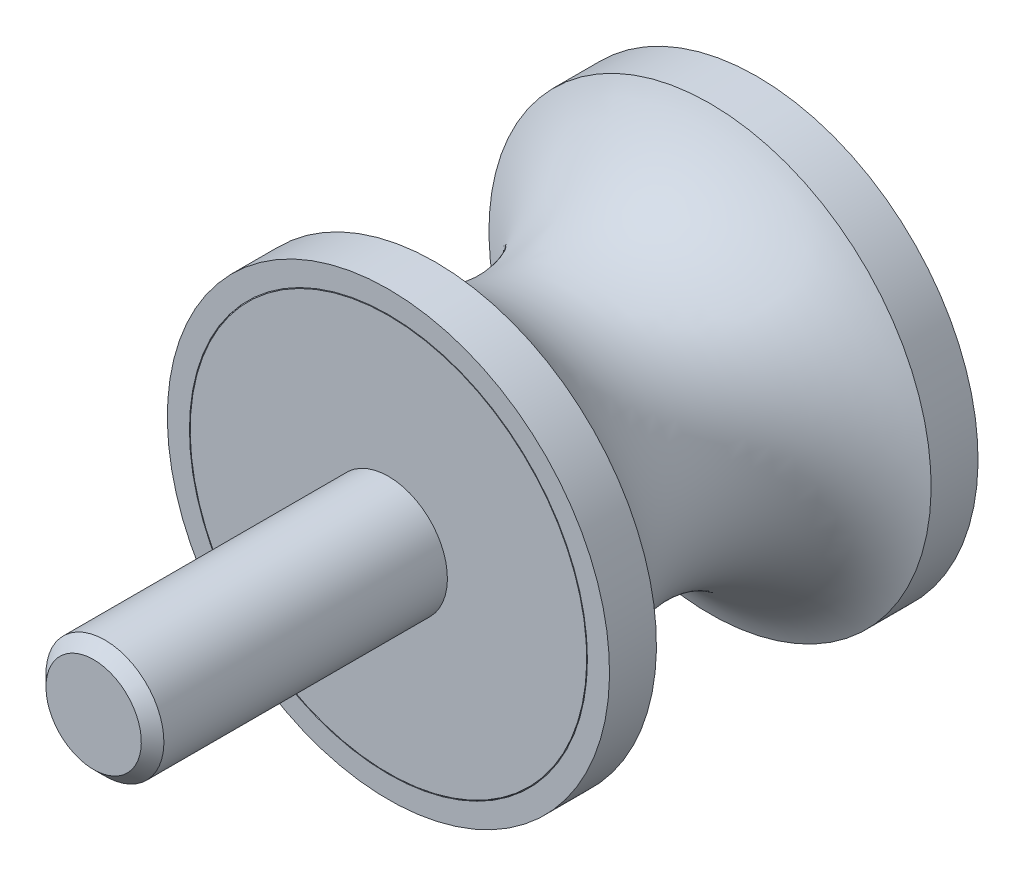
ISO-10303-21;
HEADER;
FILE_DESCRIPTION(('STEP AP214'),'2;1');
FILE_NAME('part.step','',(''),(''),'','','');
FILE_SCHEMA(('AUTOMOTIVE_DESIGN { 1 0 10303 214 1 1 1 1 }'));
ENDSEC;
DATA;
#1=APPLICATION_CONTEXT('core data for automotive mechanical design processes');
#2=APPLICATION_PROTOCOL_DEFINITION('international standard','automotive_design',2000,#1);
#3=PRODUCT_CONTEXT('',#1,'mechanical');
#4=PRODUCT('Part','Part','',(#3));
#5=PRODUCT_RELATED_PRODUCT_CATEGORY('part','',(#4));
#6=PRODUCT_DEFINITION_FORMATION('','',#4);
#7=PRODUCT_DEFINITION_CONTEXT('part definition',#1,'design');
#8=PRODUCT_DEFINITION('design','',#6,#7);
#9=PRODUCT_DEFINITION_SHAPE('','',#8);
#10=(LENGTH_UNIT() NAMED_UNIT(*) SI_UNIT(.MILLI.,.METRE.));
#11=(NAMED_UNIT(*) PLANE_ANGLE_UNIT() SI_UNIT($,.RADIAN.));
#12=(NAMED_UNIT(*) SI_UNIT($,.STERADIAN.) SOLID_ANGLE_UNIT());
#13=UNCERTAINTY_MEASURE_WITH_UNIT(LENGTH_MEASURE(1.E-05),#10,'distance_accuracy_value','');
#14=(GEOMETRIC_REPRESENTATION_CONTEXT(3) GLOBAL_UNCERTAINTY_ASSIGNED_CONTEXT((#13)) GLOBAL_UNIT_ASSIGNED_CONTEXT((#10,
#11,#12)) REPRESENTATION_CONTEXT('',''));
#15=CARTESIAN_POINT('',(0.,0.,0.));
#16=DIRECTION('',(0.,0.,1.));
#17=DIRECTION('',(1.,0.,0.));
#18=AXIS2_PLACEMENT_3D('',#15,#16,#17);
#19=CARTESIAN_POINT('',(0.,0.,0.5));
#20=DIRECTION('',(0.,0.,-1.));
#21=DIRECTION('',(0.,1.,0.));
#22=AXIS2_PLACEMENT_3D('',#19,#20,#21);
#23=CYLINDRICAL_SURFACE('',#22,13.5);
#24=CARTESIAN_POINT('',(0.,0.,0.05));
#25=DIRECTION('',(0.,0.,-1.));
#26=DIRECTION('',(0.,1.,0.));
#27=AXIS2_PLACEMENT_3D('',#24,#25,#26);
#28=CIRCLE('',#27,13.5);
#29=CARTESIAN_POINT('',(0.,13.5,0.05));
#30=VERTEX_POINT('',#29);
#31=EDGE_CURVE('E53',#30,#30,#28,.T.);
#32=ORIENTED_EDGE('',*,*,#31,.F.);
#33=EDGE_LOOP('',(#32));
#34=FACE_BOUND('',#33,.T.);
#35=CARTESIAN_POINT('',(0.,0.,0.));
#36=DIRECTION('',(0.,0.,-1.));
#37=DIRECTION('',(0.,1.,0.));
#38=AXIS2_PLACEMENT_3D('',#35,#36,#37);
#39=CIRCLE('',#38,13.5);
#40=CARTESIAN_POINT('',(0.,13.5,0.));
#41=VERTEX_POINT('',#40);
#42=EDGE_CURVE('E44',#41,#41,#39,.T.);
#43=ORIENTED_EDGE('',*,*,#42,.T.);
#44=EDGE_LOOP('',(#43));
#45=FACE_BOUND('',#44,.T.);
#46=ADVANCED_FACE('F12',(#34,#45),#23,.F.);
#47=CARTESIAN_POINT('',(0.,0.,0.5));
#48=DIRECTION('',(0.,0.,-1.));
#49=DIRECTION('',(0.,1.,0.));
#50=AXIS2_PLACEMENT_3D('',#47,#48,#49);
#51=CYLINDRICAL_SURFACE('',#50,13.5);
#52=CARTESIAN_POINT('',(0.,0.,25.));
#53=DIRECTION('',(0.,0.,-1.));
#54=DIRECTION('',(0.,1.,0.));
#55=AXIS2_PLACEMENT_3D('',#52,#53,#54);
#56=CIRCLE('',#55,13.5);
#57=CARTESIAN_POINT('',(0.,13.5,25.));
#58=VERTEX_POINT('',#57);
#59=EDGE_CURVE('E27',#58,#58,#56,.T.);
#60=ORIENTED_EDGE('',*,*,#59,.F.);
#61=EDGE_LOOP('',(#60));
#62=FACE_BOUND('',#61,.T.);
#63=CARTESIAN_POINT('',(0.,0.,24.95));
#64=DIRECTION('',(0.,0.,-1.));
#65=DIRECTION('',(0.,1.,0.));
#66=AXIS2_PLACEMENT_3D('',#63,#64,#65);
#67=CIRCLE('',#66,13.5);
#68=CARTESIAN_POINT('',(0.,13.5,24.95));
#69=VERTEX_POINT('',#68);
#70=EDGE_CURVE('E50',#69,#69,#67,.T.);
#71=ORIENTED_EDGE('',*,*,#70,.T.);
#72=EDGE_LOOP('',(#71));
#73=FACE_BOUND('',#72,.T.);
#74=ADVANCED_FACE('F89',(#62,#73),#51,.F.);
#75=CARTESIAN_POINT('',(13.5,0.,25.));
#76=DIRECTION('',(0.,0.,-1.));
#77=DIRECTION('',(0.,1.,0.));
#78=AXIS2_PLACEMENT_3D('',#75,#76,#77);
#79=PLANE('',#78);
#80=CARTESIAN_POINT('',(0.,0.,25.));
#81=DIRECTION('',(0.,0.,-1.));
#82=DIRECTION('',(0.,1.,0.));
#83=AXIS2_PLACEMENT_3D('',#80,#81,#82);
#84=CIRCLE('',#83,15.);
#85=CARTESIAN_POINT('',(0.,15.,25.));
#86=VERTEX_POINT('',#85);
#87=EDGE_CURVE('E32',#86,#86,#84,.T.);
#88=ORIENTED_EDGE('',*,*,#87,.F.);
#89=EDGE_LOOP('',(#88));
#90=FACE_BOUND('',#89,.T.);
#91=ORIENTED_EDGE('',*,*,#59,.T.);
#92=EDGE_LOOP('',(#91));
#93=FACE_BOUND('',#92,.T.);
#94=ADVANCED_FACE('F115',(#90,#93),#79,.F.);
#95=CARTESIAN_POINT('',(0.,0.,0.5));
#96=DIRECTION('',(0.,0.,-1.));
#97=DIRECTION('',(0.,1.,0.));
#98=AXIS2_PLACEMENT_3D('',#95,#96,#97);
#99=CYLINDRICAL_SURFACE('',#98,15.);
#100=CARTESIAN_POINT('',(0.,0.,21.8169499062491));
#101=DIRECTION('',(0.,0.,-1.));
#102=DIRECTION('',(0.,1.,0.));
#103=AXIS2_PLACEMENT_3D('',#100,#101,#102);
#104=CIRCLE('',#103,15.);
#105=CARTESIAN_POINT('',(0.,15.,21.8169499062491));
#106=VERTEX_POINT('',#105);
#107=EDGE_CURVE('E35',#106,#106,#104,.T.);
#108=ORIENTED_EDGE('',*,*,#107,.F.);
#109=EDGE_LOOP('',(#108));
#110=FACE_BOUND('',#109,.T.);
#111=ORIENTED_EDGE('',*,*,#87,.T.);
#112=EDGE_LOOP('',(#111));
#113=FACE_BOUND('',#112,.T.);
#114=ADVANCED_FACE('F109',(#110,#113),#99,.T.);
#115=CARTESIAN_POINT('',(0.,0.,12.5));
#116=DIRECTION('',(0.,0.,-1.));
#117=DIRECTION('',(0.,1.,0.));
#118=AXIS2_PLACEMENT_3D('',#115,#116,#117);
#119=TOROIDAL_SURFACE('',#118,19.2337962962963,10.2337962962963);
#120=CARTESIAN_POINT('',(0.,0.,3.18305009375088));
#121=DIRECTION('',(0.,0.,-1.));
#122=DIRECTION('',(0.,1.,0.));
#123=AXIS2_PLACEMENT_3D('',#120,#121,#122);
#124=CIRCLE('',#123,15.);
#125=CARTESIAN_POINT('',(0.,15.,3.18305009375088));
#126=VERTEX_POINT('',#125);
#127=EDGE_CURVE('E38',#126,#126,#124,.T.);
#128=ORIENTED_EDGE('',*,*,#127,.F.);
#129=EDGE_LOOP('',(#128));
#130=FACE_BOUND('',#129,.T.);
#131=ORIENTED_EDGE('',*,*,#107,.T.);
#132=EDGE_LOOP('',(#131));
#133=FACE_BOUND('',#132,.T.);
#134=ADVANCED_FACE('F103',(#130,#133),#119,.F.);
#135=CARTESIAN_POINT('',(0.,0.,0.5));
#136=DIRECTION('',(0.,0.,-1.));
#137=DIRECTION('',(0.,1.,0.));
#138=AXIS2_PLACEMENT_3D('',#135,#136,#137);
#139=CYLINDRICAL_SURFACE('',#138,15.);
#140=CARTESIAN_POINT('',(0.,0.,0.));
#141=DIRECTION('',(0.,0.,-1.));
#142=DIRECTION('',(0.,1.,0.));
#143=AXIS2_PLACEMENT_3D('',#140,#141,#142);
#144=CIRCLE('',#143,15.);
#145=CARTESIAN_POINT('',(0.,15.,0.));
#146=VERTEX_POINT('',#145);
#147=EDGE_CURVE('E41',#146,#146,#144,.T.);
#148=ORIENTED_EDGE('',*,*,#147,.F.);
#149=EDGE_LOOP('',(#148));
#150=FACE_BOUND('',#149,.T.);
#151=ORIENTED_EDGE('',*,*,#127,.T.);
#152=EDGE_LOOP('',(#151));
#153=FACE_BOUND('',#152,.T.);
#154=ADVANCED_FACE('F97',(#150,#153),#139,.T.);
#155=CARTESIAN_POINT('',(15.,0.,0.));
#156=DIRECTION('',(0.,0.,1.));
#157=DIRECTION('',(0.,-1.,0.));
#158=AXIS2_PLACEMENT_3D('',#155,#156,#157);
#159=PLANE('',#158);
#160=ORIENTED_EDGE('',*,*,#42,.F.);
#161=EDGE_LOOP('',(#160));
#162=FACE_BOUND('',#161,.T.);
#163=ORIENTED_EDGE('',*,*,#147,.T.);
#164=EDGE_LOOP('',(#163));
#165=FACE_BOUND('',#164,.T.);
#166=ADVANCED_FACE('F93',(#162,#165),#159,.F.);
#167=CARTESIAN_POINT('',(0.,0.,25.));
#168=DIRECTION('',(0.,0.,-1.));
#169=DIRECTION('',(0.,1.,0.));
#170=AXIS2_PLACEMENT_3D('',#167,#168,#169);
#171=PLANE('',#170);
#172=CARTESIAN_POINT('',(0.,0.,25.));
#173=DIRECTION('',(0.,0.,-1.));
#174=DIRECTION('',(0.,1.,0.));
#175=AXIS2_PLACEMENT_3D('',#172,#173,#174);
#176=CIRCLE('',#175,13.45);
#177=CARTESIAN_POINT('',(0.,13.45,25.));
#178=VERTEX_POINT('',#177);
#179=EDGE_CURVE('E47',#178,#178,#176,.T.);
#180=ORIENTED_EDGE('',*,*,#179,.F.);
#181=EDGE_LOOP('',(#180));
#182=FACE_BOUND('',#181,.T.);
#183=CARTESIAN_POINT('',(0.,0.,25.));
#184=DIRECTION('',(0.,0.,-1.));
#185=DIRECTION('',(0.,1.,0.));
#186=AXIS2_PLACEMENT_3D('',#183,#184,#185);
#187=CIRCLE('',#186,4.);
#188=CARTESIAN_POINT('',(0.,4.,25.));
#189=VERTEX_POINT('',#188);
#190=EDGE_CURVE('E8',#189,#189,#187,.T.);
#191=ORIENTED_EDGE('',*,*,#190,.T.);
#192=EDGE_LOOP('',(#191));
#193=FACE_BOUND('',#192,.T.);
#194=ADVANCED_FACE('F96',(#182,#193),#171,.F.);
#195=CARTESIAN_POINT('',(0.,0.,25.));
#196=DIRECTION('',(0.,0.,-1.));
#197=DIRECTION('',(0.,1.,0.));
#198=AXIS2_PLACEMENT_3D('',#195,#196,#197);
#199=CONICAL_SURFACE('',#198,13.45,0.785398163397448);
#200=ORIENTED_EDGE('',*,*,#70,.F.);
#201=EDGE_LOOP('',(#200));
#202=FACE_BOUND('',#201,.T.);
#203=ORIENTED_EDGE('',*,*,#179,.T.);
#204=EDGE_LOOP('',(#203));
#205=FACE_BOUND('',#204,.T.);
#206=ADVANCED_FACE('F129',(#202,#205),#199,.T.);
#207=CARTESIAN_POINT('',(0.,0.,45.));
#208=DIRECTION('',(0.,0.,-1.));
#209=DIRECTION('',(0.,1.,0.));
#210=AXIS2_PLACEMENT_3D('',#207,#208,#209);
#211=PLANE('',#210);
#212=CARTESIAN_POINT('',(0.,0.,45.));
#213=DIRECTION('',(0.,0.,-1.));
#214=DIRECTION('',(0.,1.,0.));
#215=AXIS2_PLACEMENT_3D('',#212,#213,#214);
#216=CIRCLE('',#215,3.233);
#217=CARTESIAN_POINT('',(0.,3.233,45.));
#218=VERTEX_POINT('',#217);
#219=EDGE_CURVE('E19',#218,#218,#216,.T.);
#220=ORIENTED_EDGE('',*,*,#219,.F.);
#221=EDGE_LOOP('',(#220));
#222=FACE_BOUND('',#221,.T.);
#223=ADVANCED_FACE('F14',(#222),#211,.F.);
#224=CARTESIAN_POINT('',(0.,0.,45.));
#225=DIRECTION('',(0.,0.,-1.));
#226=DIRECTION('',(0.,1.,0.));
#227=AXIS2_PLACEMENT_3D('',#224,#225,#226);
#228=CONICAL_SURFACE('',#227,3.233,0.785398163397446);
#229=CARTESIAN_POINT('',(0.,0.,44.233));
#230=DIRECTION('',(0.,0.,-1.));
#231=DIRECTION('',(0.,1.,0.));
#232=AXIS2_PLACEMENT_3D('',#229,#230,#231);
#233=CIRCLE('',#232,4.);
#234=CARTESIAN_POINT('',(0.,4.,44.233));
#235=VERTEX_POINT('',#234);
#236=EDGE_CURVE('E23',#235,#235,#233,.T.);
#237=ORIENTED_EDGE('',*,*,#236,.F.);
#238=EDGE_LOOP('',(#237));
#239=FACE_BOUND('',#238,.T.);
#240=ORIENTED_EDGE('',*,*,#219,.T.);
#241=EDGE_LOOP('',(#240));
#242=FACE_BOUND('',#241,.T.);
#243=ADVANCED_FACE('F142',(#239,#242),#228,.T.);
#244=CARTESIAN_POINT('',(0.,0.,0.5));
#245=DIRECTION('',(0.,0.,-1.));
#246=DIRECTION('',(0.,1.,0.));
#247=AXIS2_PLACEMENT_3D('',#244,#245,#246);
#248=CYLINDRICAL_SURFACE('',#247,4.);
#249=ORIENTED_EDGE('',*,*,#190,.F.);
#250=EDGE_LOOP('',(#249));
#251=FACE_BOUND('',#250,.T.);
#252=ORIENTED_EDGE('',*,*,#236,.T.);
#253=EDGE_LOOP('',(#252));
#254=FACE_BOUND('',#253,.T.);
#255=ADVANCED_FACE('F83',(#251,#254),#248,.T.);
#256=CARTESIAN_POINT('',(0.,0.,0.05));
#257=DIRECTION('',(0.,0.,1.));
#258=DIRECTION('',(0.,-1.,0.));
#259=AXIS2_PLACEMENT_3D('',#256,#257,#258);
#260=CONICAL_SURFACE('',#259,13.5,0.785398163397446);
#261=CARTESIAN_POINT('',(0.,0.,0.));
#262=DIRECTION('',(0.,0.,-1.));
#263=DIRECTION('',(0.,1.,0.));
#264=AXIS2_PLACEMENT_3D('',#261,#262,#263);
#265=CIRCLE('',#264,13.45);
#266=CARTESIAN_POINT('',(0.,13.45,0.));
#267=VERTEX_POINT('',#266);
#268=EDGE_CURVE('E56',#267,#267,#265,.T.);
#269=ORIENTED_EDGE('',*,*,#268,.F.);
#270=EDGE_LOOP('',(#269));
#271=FACE_BOUND('',#270,.T.);
#272=ORIENTED_EDGE('',*,*,#31,.T.);
#273=EDGE_LOOP('',(#272));
#274=FACE_BOUND('',#273,.T.);
#275=ADVANCED_FACE('F77',(#271,#274),#260,.T.);
#276=CARTESIAN_POINT('',(13.45,0.,0.));
#277=DIRECTION('',(0.,0.,1.));
#278=DIRECTION('',(0.,-1.,0.));
#279=AXIS2_PLACEMENT_3D('',#276,#277,#278);
#280=PLANE('',#279);
#281=CARTESIAN_POINT('',(0.,0.,0.));
#282=DIRECTION('',(0.,0.,-1.));
#283=DIRECTION('',(0.,1.,0.));
#284=AXIS2_PLACEMENT_3D('',#281,#282,#283);
#285=CIRCLE('',#284,4.);
#286=CARTESIAN_POINT('',(0.,4.,0.));
#287=VERTEX_POINT('',#286);
#288=EDGE_CURVE('E60',#287,#287,#285,.T.);
#289=ORIENTED_EDGE('',*,*,#288,.F.);
#290=EDGE_LOOP('',(#289));
#291=FACE_BOUND('',#290,.T.);
#292=ORIENTED_EDGE('',*,*,#268,.T.);
#293=EDGE_LOOP('',(#292));
#294=FACE_BOUND('',#293,.T.);
#295=ADVANCED_FACE('F71',(#291,#294),#280,.F.);
#296=CARTESIAN_POINT('',(0.,0.,8.));
#297=DIRECTION('',(0.,0.,-1.));
#298=DIRECTION('',(0.,1.,0.));
#299=AXIS2_PLACEMENT_3D('',#296,#297,#298);
#300=CYLINDRICAL_SURFACE('',#299,4.);
#301=CARTESIAN_POINT('',(0.,0.,8.));
#302=DIRECTION('',(0.,0.,-1.));
#303=DIRECTION('',(0.,1.,0.));
#304=AXIS2_PLACEMENT_3D('',#301,#302,#303);
#305=CIRCLE('',#304,4.);
#306=CARTESIAN_POINT('',(0.,4.,8.));
#307=VERTEX_POINT('',#306);
#308=EDGE_CURVE('E59',#307,#307,#305,.T.);
#309=ORIENTED_EDGE('',*,*,#308,.F.);
#310=EDGE_LOOP('',(#309));
#311=FACE_BOUND('',#310,.T.);
#312=ORIENTED_EDGE('',*,*,#288,.T.);
#313=EDGE_LOOP('',(#312));
#314=FACE_BOUND('',#313,.T.);
#315=ADVANCED_FACE('F68',(#311,#314),#300,.F.);
#316=CARTESIAN_POINT('',(0.,0.,8.));
#317=DIRECTION('',(0.,0.,-1.));
#318=DIRECTION('',(0.,1.,0.));
#319=AXIS2_PLACEMENT_3D('',#316,#317,#318);
#320=PLANE('',#319);
#321=ORIENTED_EDGE('',*,*,#308,.T.);
#322=EDGE_LOOP('',(#321));
#323=FACE_BOUND('',#322,.T.);
#324=ADVANCED_FACE('F66',(#323),#320,.T.);
#325=CLOSED_SHELL('',(#46,#74,#94,#114,#134,#154,#166,#194,#206,#223,#243,#255,#275,#295,#315,#324));
#326=MANIFOLD_SOLID_BREP('B1',#325);
#327=ADVANCED_BREP_SHAPE_REPRESENTATION('',(#18,#326),#14);
#328=SHAPE_DEFINITION_REPRESENTATION(#9,#327);
ENDSEC;
END-ISO-10303-21;
